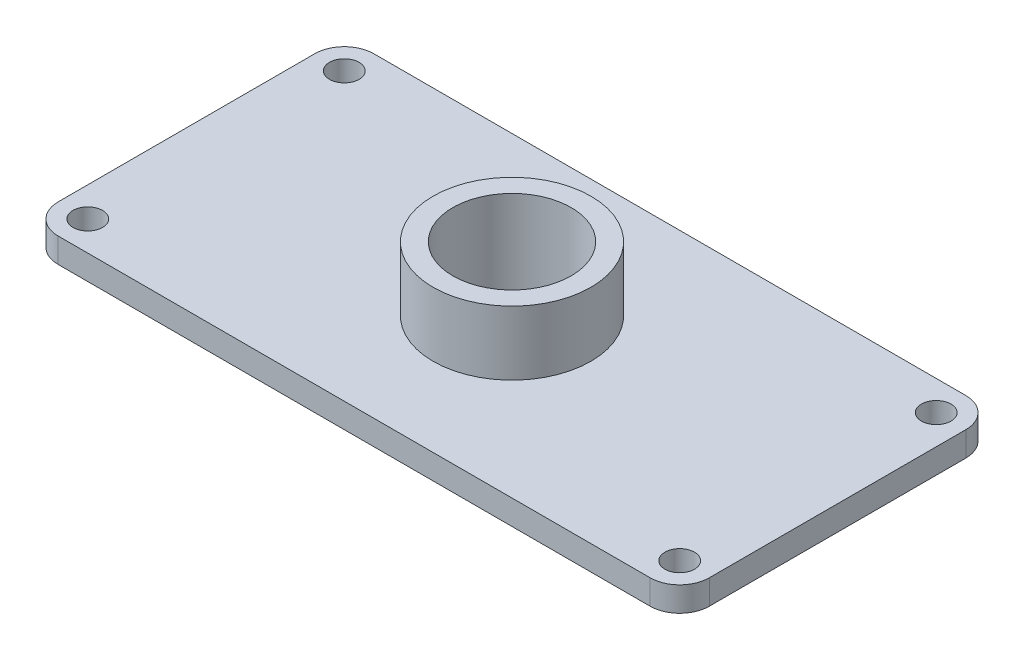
ISO-10303-21;
HEADER;
FILE_DESCRIPTION(('STEP AP214'),'2;1');
FILE_NAME('part.step','',(''),(''),'','','');
FILE_SCHEMA(('AUTOMOTIVE_DESIGN { 1 0 10303 214 1 1 1 1 }'));
ENDSEC;
DATA;
#1=APPLICATION_CONTEXT('core data for automotive mechanical design processes');
#2=APPLICATION_PROTOCOL_DEFINITION('international standard','automotive_design',2000,#1);
#3=PRODUCT_CONTEXT('',#1,'mechanical');
#4=PRODUCT('Part','Part','',(#3));
#5=PRODUCT_RELATED_PRODUCT_CATEGORY('part','',(#4));
#6=PRODUCT_DEFINITION_FORMATION('','',#4);
#7=PRODUCT_DEFINITION_CONTEXT('part definition',#1,'design');
#8=PRODUCT_DEFINITION('design','',#6,#7);
#9=PRODUCT_DEFINITION_SHAPE('','',#8);
#10=(LENGTH_UNIT() NAMED_UNIT(*) SI_UNIT(.MILLI.,.METRE.));
#11=(NAMED_UNIT(*) PLANE_ANGLE_UNIT() SI_UNIT($,.RADIAN.));
#12=(NAMED_UNIT(*) SI_UNIT($,.STERADIAN.) SOLID_ANGLE_UNIT());
#13=UNCERTAINTY_MEASURE_WITH_UNIT(LENGTH_MEASURE(1.E-05),#10,'distance_accuracy_value','');
#14=(GEOMETRIC_REPRESENTATION_CONTEXT(3) GLOBAL_UNCERTAINTY_ASSIGNED_CONTEXT((#13)) GLOBAL_UNIT_ASSIGNED_CONTEXT((#10,
#11,#12)) REPRESENTATION_CONTEXT('',''));
#15=CARTESIAN_POINT('',(0.,0.,0.));
#16=DIRECTION('',(0.,0.,1.));
#17=DIRECTION('',(1.,0.,0.));
#18=AXIS2_PLACEMENT_3D('',#15,#16,#17);
#19=CARTESIAN_POINT('',(60.,5.,-26.));
#20=DIRECTION('',(0.,-1.,0.));
#21=DIRECTION('',(0.,0.,-1.));
#22=AXIS2_PLACEMENT_3D('',#19,#20,#21);
#23=PLANE('',#22);
#24=CARTESIAN_POINT('',(-60.,5.,26.));
#25=DIRECTION('',(0.,1.,0.));
#26=DIRECTION('',(0.,0.,1.));
#27=AXIS2_PLACEMENT_3D('',#24,#25,#26);
#28=CIRCLE('',#27,3.);
#29=CARTESIAN_POINT('',(-60.,5.,29.));
#30=VERTEX_POINT('',#29);
#31=EDGE_CURVE('E212',#30,#30,#28,.T.);
#32=ORIENTED_EDGE('',*,*,#31,.F.);
#33=EDGE_LOOP('',(#32));
#34=FACE_BOUND('',#33,.T.);
#35=CARTESIAN_POINT('',(60.,5.,26.));
#36=DIRECTION('',(0.,1.,0.));
#37=DIRECTION('',(0.,0.,1.));
#38=AXIS2_PLACEMENT_3D('',#35,#36,#37);
#39=CIRCLE('',#38,3.);
#40=CARTESIAN_POINT('',(60.,5.,29.));
#41=VERTEX_POINT('',#40);
#42=EDGE_CURVE('E206',#41,#41,#39,.T.);
#43=ORIENTED_EDGE('',*,*,#42,.F.);
#44=EDGE_LOOP('',(#43));
#45=FACE_BOUND('',#44,.T.);
#46=CARTESIAN_POINT('',(60.,5.,-26.));
#47=DIRECTION('',(0.,1.,0.));
#48=DIRECTION('',(0.,0.,1.));
#49=AXIS2_PLACEMENT_3D('',#46,#47,#48);
#50=CIRCLE('',#49,3.);
#51=CARTESIAN_POINT('',(60.,5.,-23.));
#52=VERTEX_POINT('',#51);
#53=EDGE_CURVE('E200',#52,#52,#50,.T.);
#54=ORIENTED_EDGE('',*,*,#53,.F.);
#55=EDGE_LOOP('',(#54));
#56=FACE_BOUND('',#55,.T.);
#57=CARTESIAN_POINT('',(-60.,5.,-26.));
#58=DIRECTION('',(0.,1.,0.));
#59=DIRECTION('',(0.,0.,1.));
#60=AXIS2_PLACEMENT_3D('',#57,#58,#59);
#61=CIRCLE('',#60,3.);
#62=CARTESIAN_POINT('',(-60.,5.,-23.));
#63=VERTEX_POINT('',#62);
#64=EDGE_CURVE('E196',#63,#63,#61,.T.);
#65=ORIENTED_EDGE('',*,*,#64,.F.);
#66=EDGE_LOOP('',(#65));
#67=FACE_BOUND('',#66,.T.);
#68=CARTESIAN_POINT('',(60.,5.,-26.));
#69=DIRECTION('',(0.,1.,0.));
#70=DIRECTION('',(0.,0.,-1.));
#71=AXIS2_PLACEMENT_3D('',#68,#69,#70);
#72=CIRCLE('',#71,6.);
#73=CARTESIAN_POINT('',(66.,5.,-26.));
#74=VERTEX_POINT('',#73);
#75=CARTESIAN_POINT('',(60.,5.,-32.));
#76=VERTEX_POINT('',#75);
#77=EDGE_CURVE('E156',#74,#76,#72,.T.);
#78=ORIENTED_EDGE('',*,*,#77,.T.);
#79=DIRECTION('',(-1.,0.,0.));
#80=VECTOR('',#79,1.);
#81=CARTESIAN_POINT('',(-60.,5.,-32.));
#82=LINE('',#81,#80);
#83=CARTESIAN_POINT('',(-60.,5.,-32.));
#84=VERTEX_POINT('',#83);
#85=EDGE_CURVE('E104',#76,#84,#82,.T.);
#86=ORIENTED_EDGE('',*,*,#85,.T.);
#87=CARTESIAN_POINT('',(-60.,5.,-26.));
#88=DIRECTION('',(0.,1.,0.));
#89=DIRECTION('',(0.,0.,-1.));
#90=AXIS2_PLACEMENT_3D('',#87,#88,#89);
#91=CIRCLE('',#90,6.);
#92=CARTESIAN_POINT('',(-66.,5.,-26.));
#93=VERTEX_POINT('',#92);
#94=EDGE_CURVE('E188',#84,#93,#91,.T.);
#95=ORIENTED_EDGE('',*,*,#94,.T.);
#96=DIRECTION('',(0.,0.,1.));
#97=VECTOR('',#96,1.);
#98=CARTESIAN_POINT('',(-66.,5.,26.));
#99=LINE('',#98,#97);
#100=CARTESIAN_POINT('',(-66.,5.,26.));
#101=VERTEX_POINT('',#100);
#102=EDGE_CURVE('E187',#93,#101,#99,.T.);
#103=ORIENTED_EDGE('',*,*,#102,.T.);
#104=CARTESIAN_POINT('',(-60.,5.,26.));
#105=DIRECTION('',(0.,1.,0.));
#106=DIRECTION('',(0.,0.,-1.));
#107=AXIS2_PLACEMENT_3D('',#104,#105,#106);
#108=CIRCLE('',#107,6.);
#109=CARTESIAN_POINT('',(-60.,5.,32.));
#110=VERTEX_POINT('',#109);
#111=EDGE_CURVE('E123',#101,#110,#108,.T.);
#112=ORIENTED_EDGE('',*,*,#111,.T.);
#113=DIRECTION('',(1.,0.,0.));
#114=VECTOR('',#113,1.);
#115=CARTESIAN_POINT('',(-60.,5.,32.));
#116=LINE('',#115,#114);
#117=CARTESIAN_POINT('',(60.,5.,32.));
#118=VERTEX_POINT('',#117);
#119=EDGE_CURVE('E117',#110,#118,#116,.T.);
#120=ORIENTED_EDGE('',*,*,#119,.T.);
#121=CARTESIAN_POINT('',(60.,5.,26.));
#122=DIRECTION('',(0.,1.,0.));
#123=DIRECTION('',(0.,0.,-1.));
#124=AXIS2_PLACEMENT_3D('',#121,#122,#123);
#125=CIRCLE('',#124,6.);
#126=CARTESIAN_POINT('',(66.,5.,26.));
#127=VERTEX_POINT('',#126);
#128=EDGE_CURVE('E121',#118,#127,#125,.T.);
#129=ORIENTED_EDGE('',*,*,#128,.T.);
#130=DIRECTION('',(0.,0.,-1.));
#131=VECTOR('',#130,1.);
#132=CARTESIAN_POINT('',(66.,5.,26.));
#133=LINE('',#132,#131);
#134=EDGE_CURVE('E60',#127,#74,#133,.T.);
#135=ORIENTED_EDGE('',*,*,#134,.T.);
#136=EDGE_LOOP('',(#78,#86,#95,#103,#112,#120,#129,#135));
#137=FACE_BOUND('',#136,.T.);
#138=CARTESIAN_POINT('',(0.,5.,0.));
#139=DIRECTION('',(0.,-1.,0.));
#140=DIRECTION('',(0.,0.,-1.));
#141=AXIS2_PLACEMENT_3D('',#138,#139,#140);
#142=CIRCLE('',#141,16.);
#143=CARTESIAN_POINT('',(0.,5.,-16.));
#144=VERTEX_POINT('',#143);
#145=EDGE_CURVE('E11',#144,#144,#142,.F.);
#146=ORIENTED_EDGE('',*,*,#145,.F.);
#147=EDGE_LOOP('',(#146));
#148=FACE_BOUND('',#147,.T.);
#149=ADVANCED_FACE('F43',(#34,#45,#56,#67,#137,#148),#23,.F.);
#150=CARTESIAN_POINT('',(60.,0.,-26.));
#151=DIRECTION('',(0.,-1.,0.));
#152=DIRECTION('',(0.,0.,-1.));
#153=AXIS2_PLACEMENT_3D('',#150,#151,#152);
#154=PLANE('',#153);
#155=CARTESIAN_POINT('',(60.,0.,26.));
#156=DIRECTION('',(0.,1.,0.));
#157=DIRECTION('',(0.,0.,1.));
#158=AXIS2_PLACEMENT_3D('',#155,#156,#157);
#159=CIRCLE('',#158,3.);
#160=CARTESIAN_POINT('',(60.,0.,29.));
#161=VERTEX_POINT('',#160);
#162=EDGE_CURVE('E209',#161,#161,#159,.T.);
#163=ORIENTED_EDGE('',*,*,#162,.T.);
#164=EDGE_LOOP('',(#163));
#165=FACE_BOUND('',#164,.T.);
#166=CARTESIAN_POINT('',(-60.,0.,-26.));
#167=DIRECTION('',(0.,1.,0.));
#168=DIRECTION('',(0.,0.,1.));
#169=AXIS2_PLACEMENT_3D('',#166,#167,#168);
#170=CIRCLE('',#169,3.);
#171=CARTESIAN_POINT('',(-60.,0.,-23.));
#172=VERTEX_POINT('',#171);
#173=EDGE_CURVE('E197',#172,#172,#170,.T.);
#174=ORIENTED_EDGE('',*,*,#173,.T.);
#175=EDGE_LOOP('',(#174));
#176=FACE_BOUND('',#175,.T.);
#177=CARTESIAN_POINT('',(60.,0.,-26.));
#178=DIRECTION('',(0.,1.,0.));
#179=DIRECTION('',(0.,0.,-1.));
#180=AXIS2_PLACEMENT_3D('',#177,#178,#179);
#181=CIRCLE('',#180,6.);
#182=CARTESIAN_POINT('',(66.,0.,-26.));
#183=VERTEX_POINT('',#182);
#184=CARTESIAN_POINT('',(60.,0.,-32.));
#185=VERTEX_POINT('',#184);
#186=EDGE_CURVE('E141',#183,#185,#181,.T.);
#187=ORIENTED_EDGE('',*,*,#186,.F.);
#188=DIRECTION('',(0.,0.,-1.));
#189=VECTOR('',#188,1.);
#190=CARTESIAN_POINT('',(66.,0.,26.));
#191=LINE('',#190,#189);
#192=CARTESIAN_POINT('',(66.,0.,26.));
#193=VERTEX_POINT('',#192);
#194=EDGE_CURVE('E95',#193,#183,#191,.T.);
#195=ORIENTED_EDGE('',*,*,#194,.F.);
#196=CARTESIAN_POINT('',(60.,0.,26.));
#197=DIRECTION('',(0.,1.,0.));
#198=DIRECTION('',(0.,0.,-1.));
#199=AXIS2_PLACEMENT_3D('',#196,#197,#198);
#200=CIRCLE('',#199,6.);
#201=CARTESIAN_POINT('',(60.,0.,32.));
#202=VERTEX_POINT('',#201);
#203=EDGE_CURVE('E89',#202,#193,#200,.T.);
#204=ORIENTED_EDGE('',*,*,#203,.F.);
#205=DIRECTION('',(1.,0.,0.));
#206=VECTOR('',#205,1.);
#207=CARTESIAN_POINT('',(-60.,0.,32.));
#208=LINE('',#207,#206);
#209=CARTESIAN_POINT('',(-60.,0.,32.));
#210=VERTEX_POINT('',#209);
#211=EDGE_CURVE('E131',#210,#202,#208,.T.);
#212=ORIENTED_EDGE('',*,*,#211,.F.);
#213=CARTESIAN_POINT('',(-60.,0.,26.));
#214=DIRECTION('',(0.,1.,0.));
#215=DIRECTION('',(0.,0.,-1.));
#216=AXIS2_PLACEMENT_3D('',#213,#214,#215);
#217=CIRCLE('',#216,6.);
#218=CARTESIAN_POINT('',(-66.,0.,26.));
#219=VERTEX_POINT('',#218);
#220=EDGE_CURVE('E151',#219,#210,#217,.T.);
#221=ORIENTED_EDGE('',*,*,#220,.F.);
#222=DIRECTION('',(0.,0.,1.));
#223=VECTOR('',#222,1.);
#224=CARTESIAN_POINT('',(-66.,0.,26.));
#225=LINE('',#224,#223);
#226=CARTESIAN_POINT('',(-66.,0.,-26.));
#227=VERTEX_POINT('',#226);
#228=EDGE_CURVE('E149',#227,#219,#225,.T.);
#229=ORIENTED_EDGE('',*,*,#228,.F.);
#230=CARTESIAN_POINT('',(-60.,0.,-26.));
#231=DIRECTION('',(0.,1.,0.));
#232=DIRECTION('',(0.,0.,-1.));
#233=AXIS2_PLACEMENT_3D('',#230,#231,#232);
#234=CIRCLE('',#233,6.);
#235=CARTESIAN_POINT('',(-60.,0.,-32.));
#236=VERTEX_POINT('',#235);
#237=EDGE_CURVE('E147',#236,#227,#234,.T.);
#238=ORIENTED_EDGE('',*,*,#237,.F.);
#239=DIRECTION('',(-1.,0.,0.));
#240=VECTOR('',#239,1.);
#241=CARTESIAN_POINT('',(-60.,0.,-32.));
#242=LINE('',#241,#240);
#243=EDGE_CURVE('E144',#185,#236,#242,.T.);
#244=ORIENTED_EDGE('',*,*,#243,.F.);
#245=EDGE_LOOP('',(#187,#195,#204,#212,#221,#229,#238,#244));
#246=FACE_BOUND('',#245,.T.);
#247=CARTESIAN_POINT('',(0.,0.,0.));
#248=DIRECTION('',(0.,1.,0.));
#249=DIRECTION('',(0.,0.,1.));
#250=AXIS2_PLACEMENT_3D('',#247,#248,#249);
#251=CIRCLE('',#250,12.);
#252=CARTESIAN_POINT('',(0.,0.,12.));
#253=VERTEX_POINT('',#252);
#254=EDGE_CURVE('E145',#253,#253,#251,.T.);
#255=ORIENTED_EDGE('',*,*,#254,.T.);
#256=EDGE_LOOP('',(#255));
#257=FACE_BOUND('',#256,.T.);
#258=CARTESIAN_POINT('',(60.,0.,-26.));
#259=DIRECTION('',(0.,1.,0.));
#260=DIRECTION('',(0.,0.,1.));
#261=AXIS2_PLACEMENT_3D('',#258,#259,#260);
#262=CIRCLE('',#261,3.);
#263=CARTESIAN_POINT('',(60.,0.,-23.));
#264=VERTEX_POINT('',#263);
#265=EDGE_CURVE('E203',#264,#264,#262,.T.);
#266=ORIENTED_EDGE('',*,*,#265,.T.);
#267=EDGE_LOOP('',(#266));
#268=FACE_BOUND('',#267,.T.);
#269=CARTESIAN_POINT('',(-60.,0.,26.));
#270=DIRECTION('',(0.,1.,0.));
#271=DIRECTION('',(0.,0.,1.));
#272=AXIS2_PLACEMENT_3D('',#269,#270,#271);
#273=CIRCLE('',#272,3.);
#274=CARTESIAN_POINT('',(-60.,0.,29.));
#275=VERTEX_POINT('',#274);
#276=EDGE_CURVE('E215',#275,#275,#273,.T.);
#277=ORIENTED_EDGE('',*,*,#276,.T.);
#278=EDGE_LOOP('',(#277));
#279=FACE_BOUND('',#278,.T.);
#280=ADVANCED_FACE('F174',(#165,#176,#246,#257,#268,#279),#154,.T.);
#281=CARTESIAN_POINT('',(60.,5.,-26.));
#282=DIRECTION('',(0.,-1.,0.));
#283=DIRECTION('',(0.,0.,-1.));
#284=AXIS2_PLACEMENT_3D('',#281,#282,#283);
#285=CYLINDRICAL_SURFACE('',#284,6.);
#286=ORIENTED_EDGE('',*,*,#186,.T.);
#287=DIRECTION('',(0.,-1.,0.));
#288=VECTOR('',#287,1.);
#289=CARTESIAN_POINT('',(60.,5.,-32.));
#290=LINE('',#289,#288);
#291=EDGE_CURVE('E52',#76,#185,#290,.T.);
#292=ORIENTED_EDGE('',*,*,#291,.F.);
#293=ORIENTED_EDGE('',*,*,#77,.F.);
#294=DIRECTION('',(0.,-1.,0.));
#295=VECTOR('',#294,1.);
#296=CARTESIAN_POINT('',(66.,5.,-26.));
#297=LINE('',#296,#295);
#298=EDGE_CURVE('E137',#74,#183,#297,.T.);
#299=ORIENTED_EDGE('',*,*,#298,.T.);
#300=EDGE_LOOP('',(#286,#292,#293,#299));
#301=FACE_BOUND('',#300,.T.);
#302=ADVANCED_FACE('F45',(#301),#285,.T.);
#303=CARTESIAN_POINT('',(-60.,5.,-32.));
#304=DIRECTION('',(0.,0.,1.));
#305=DIRECTION('',(1.,0.,0.));
#306=AXIS2_PLACEMENT_3D('',#303,#304,#305);
#307=PLANE('',#306);
#308=ORIENTED_EDGE('',*,*,#243,.T.);
#309=DIRECTION('',(0.,-1.,0.));
#310=VECTOR('',#309,1.);
#311=CARTESIAN_POINT('',(-60.,5.,-32.));
#312=LINE('',#311,#310);
#313=EDGE_CURVE('E166',#84,#236,#312,.T.);
#314=ORIENTED_EDGE('',*,*,#313,.F.);
#315=ORIENTED_EDGE('',*,*,#85,.F.);
#316=ORIENTED_EDGE('',*,*,#291,.T.);
#317=EDGE_LOOP('',(#308,#314,#315,#316));
#318=FACE_BOUND('',#317,.T.);
#319=ADVANCED_FACE('F169',(#318),#307,.F.);
#320=CARTESIAN_POINT('',(-60.,5.,-26.));
#321=DIRECTION('',(0.,-1.,0.));
#322=DIRECTION('',(0.,0.,-1.));
#323=AXIS2_PLACEMENT_3D('',#320,#321,#322);
#324=CYLINDRICAL_SURFACE('',#323,6.);
#325=ORIENTED_EDGE('',*,*,#237,.T.);
#326=DIRECTION('',(0.,-1.,0.));
#327=VECTOR('',#326,1.);
#328=CARTESIAN_POINT('',(-66.,5.,-26.));
#329=LINE('',#328,#327);
#330=EDGE_CURVE('E163',#93,#227,#329,.T.);
#331=ORIENTED_EDGE('',*,*,#330,.F.);
#332=ORIENTED_EDGE('',*,*,#94,.F.);
#333=ORIENTED_EDGE('',*,*,#313,.T.);
#334=EDGE_LOOP('',(#325,#331,#332,#333));
#335=FACE_BOUND('',#334,.T.);
#336=ADVANCED_FACE('F181',(#335),#324,.T.);
#337=CARTESIAN_POINT('',(-66.,5.,26.));
#338=DIRECTION('',(1.,0.,0.));
#339=DIRECTION('',(0.,0.,-1.));
#340=AXIS2_PLACEMENT_3D('',#337,#338,#339);
#341=PLANE('',#340);
#342=ORIENTED_EDGE('',*,*,#228,.T.);
#343=DIRECTION('',(0.,-1.,0.));
#344=VECTOR('',#343,1.);
#345=CARTESIAN_POINT('',(-66.,5.,26.));
#346=LINE('',#345,#344);
#347=EDGE_CURVE('E160',#101,#219,#346,.T.);
#348=ORIENTED_EDGE('',*,*,#347,.F.);
#349=ORIENTED_EDGE('',*,*,#102,.F.);
#350=ORIENTED_EDGE('',*,*,#330,.T.);
#351=EDGE_LOOP('',(#342,#348,#349,#350));
#352=FACE_BOUND('',#351,.T.);
#353=ADVANCED_FACE('F185',(#352),#341,.F.);
#354=CARTESIAN_POINT('',(-60.,5.,26.));
#355=DIRECTION('',(0.,-1.,0.));
#356=DIRECTION('',(0.,0.,-1.));
#357=AXIS2_PLACEMENT_3D('',#354,#355,#356);
#358=CYLINDRICAL_SURFACE('',#357,6.);
#359=ORIENTED_EDGE('',*,*,#220,.T.);
#360=DIRECTION('',(0.,-1.,0.));
#361=VECTOR('',#360,1.);
#362=CARTESIAN_POINT('',(-60.,5.,32.));
#363=LINE('',#362,#361);
#364=EDGE_CURVE('E132',#110,#210,#363,.T.);
#365=ORIENTED_EDGE('',*,*,#364,.F.);
#366=ORIENTED_EDGE('',*,*,#111,.F.);
#367=ORIENTED_EDGE('',*,*,#347,.T.);
#368=EDGE_LOOP('',(#359,#365,#366,#367));
#369=FACE_BOUND('',#368,.T.);
#370=ADVANCED_FACE('F265',(#369),#358,.T.);
#371=CARTESIAN_POINT('',(-60.,5.,32.));
#372=DIRECTION('',(0.,0.,-1.));
#373=DIRECTION('',(-1.,0.,0.));
#374=AXIS2_PLACEMENT_3D('',#371,#372,#373);
#375=PLANE('',#374);
#376=ORIENTED_EDGE('',*,*,#211,.T.);
#377=DIRECTION('',(0.,-1.,0.));
#378=VECTOR('',#377,1.);
#379=CARTESIAN_POINT('',(60.,5.,32.));
#380=LINE('',#379,#378);
#381=EDGE_CURVE('E128',#118,#202,#380,.T.);
#382=ORIENTED_EDGE('',*,*,#381,.F.);
#383=ORIENTED_EDGE('',*,*,#119,.F.);
#384=ORIENTED_EDGE('',*,*,#364,.T.);
#385=EDGE_LOOP('',(#376,#382,#383,#384));
#386=FACE_BOUND('',#385,.T.);
#387=ADVANCED_FACE('F129',(#386),#375,.F.);
#388=CARTESIAN_POINT('',(60.,5.,26.));
#389=DIRECTION('',(0.,-1.,0.));
#390=DIRECTION('',(0.,0.,-1.));
#391=AXIS2_PLACEMENT_3D('',#388,#389,#390);
#392=CYLINDRICAL_SURFACE('',#391,6.);
#393=ORIENTED_EDGE('',*,*,#203,.T.);
#394=DIRECTION('',(0.,-1.,0.));
#395=VECTOR('',#394,1.);
#396=CARTESIAN_POINT('',(66.,5.,26.));
#397=LINE('',#396,#395);
#398=EDGE_CURVE('E133',#127,#193,#397,.T.);
#399=ORIENTED_EDGE('',*,*,#398,.F.);
#400=ORIENTED_EDGE('',*,*,#128,.F.);
#401=ORIENTED_EDGE('',*,*,#381,.T.);
#402=EDGE_LOOP('',(#393,#399,#400,#401));
#403=FACE_BOUND('',#402,.T.);
#404=ADVANCED_FACE('F135',(#403),#392,.T.);
#405=CARTESIAN_POINT('',(66.,5.,26.));
#406=DIRECTION('',(-1.,0.,0.));
#407=DIRECTION('',(0.,0.,1.));
#408=AXIS2_PLACEMENT_3D('',#405,#406,#407);
#409=PLANE('',#408);
#410=ORIENTED_EDGE('',*,*,#194,.T.);
#411=ORIENTED_EDGE('',*,*,#298,.F.);
#412=ORIENTED_EDGE('',*,*,#134,.F.);
#413=ORIENTED_EDGE('',*,*,#398,.T.);
#414=EDGE_LOOP('',(#410,#411,#412,#413));
#415=FACE_BOUND('',#414,.T.);
#416=ADVANCED_FACE('F258',(#415),#409,.F.);
#417=CARTESIAN_POINT('',(0.,5.,0.));
#418=DIRECTION('',(0.,-1.,0.));
#419=DIRECTION('',(0.,0.,-1.));
#420=AXIS2_PLACEMENT_3D('',#417,#418,#419);
#421=CYLINDRICAL_SURFACE('',#420,12.);
#422=ORIENTED_EDGE('',*,*,#254,.F.);
#423=EDGE_LOOP('',(#422));
#424=FACE_BOUND('',#423,.T.);
#425=CARTESIAN_POINT('',(0.,18.,0.));
#426=DIRECTION('',(0.,1.,0.));
#427=DIRECTION('',(0.,0.,1.));
#428=AXIS2_PLACEMENT_3D('',#425,#426,#427);
#429=CIRCLE('',#428,12.);
#430=CARTESIAN_POINT('',(0.,18.,12.));
#431=VERTEX_POINT('',#430);
#432=EDGE_CURVE('E223',#431,#431,#429,.T.);
#433=ORIENTED_EDGE('',*,*,#432,.T.);
#434=EDGE_LOOP('',(#433));
#435=FACE_BOUND('',#434,.T.);
#436=ADVANCED_FACE('F227',(#424,#435),#421,.F.);
#437=CARTESIAN_POINT('',(-60.,5.,-26.));
#438=DIRECTION('',(0.,-1.,0.));
#439=DIRECTION('',(0.,0.,-1.));
#440=AXIS2_PLACEMENT_3D('',#437,#438,#439);
#441=CYLINDRICAL_SURFACE('',#440,3.);
#442=ORIENTED_EDGE('',*,*,#64,.T.);
#443=EDGE_LOOP('',(#442));
#444=FACE_BOUND('',#443,.T.);
#445=ORIENTED_EDGE('',*,*,#173,.F.);
#446=EDGE_LOOP('',(#445));
#447=FACE_BOUND('',#446,.T.);
#448=ADVANCED_FACE('F326',(#444,#447),#441,.F.);
#449=CARTESIAN_POINT('',(60.,5.,-26.));
#450=DIRECTION('',(0.,-1.,0.));
#451=DIRECTION('',(0.,0.,-1.));
#452=AXIS2_PLACEMENT_3D('',#449,#450,#451);
#453=CYLINDRICAL_SURFACE('',#452,3.);
#454=ORIENTED_EDGE('',*,*,#53,.T.);
#455=EDGE_LOOP('',(#454));
#456=FACE_BOUND('',#455,.T.);
#457=ORIENTED_EDGE('',*,*,#265,.F.);
#458=EDGE_LOOP('',(#457));
#459=FACE_BOUND('',#458,.T.);
#460=ADVANCED_FACE('F335',(#456,#459),#453,.F.);
#461=CARTESIAN_POINT('',(60.,5.,26.));
#462=DIRECTION('',(0.,-1.,0.));
#463=DIRECTION('',(0.,0.,-1.));
#464=AXIS2_PLACEMENT_3D('',#461,#462,#463);
#465=CYLINDRICAL_SURFACE('',#464,3.);
#466=ORIENTED_EDGE('',*,*,#42,.T.);
#467=EDGE_LOOP('',(#466));
#468=FACE_BOUND('',#467,.T.);
#469=ORIENTED_EDGE('',*,*,#162,.F.);
#470=EDGE_LOOP('',(#469));
#471=FACE_BOUND('',#470,.T.);
#472=ADVANCED_FACE('F242',(#468,#471),#465,.F.);
#473=CARTESIAN_POINT('',(-60.,5.,26.));
#474=DIRECTION('',(0.,-1.,0.));
#475=DIRECTION('',(0.,0.,-1.));
#476=AXIS2_PLACEMENT_3D('',#473,#474,#475);
#477=CYLINDRICAL_SURFACE('',#476,3.);
#478=ORIENTED_EDGE('',*,*,#31,.T.);
#479=EDGE_LOOP('',(#478));
#480=FACE_BOUND('',#479,.T.);
#481=ORIENTED_EDGE('',*,*,#276,.F.);
#482=EDGE_LOOP('',(#481));
#483=FACE_BOUND('',#482,.T.);
#484=ADVANCED_FACE('F232',(#480,#483),#477,.F.);
#485=CARTESIAN_POINT('',(0.,18.,0.));
#486=DIRECTION('',(0.,1.,0.));
#487=DIRECTION('',(0.,0.,1.));
#488=AXIS2_PLACEMENT_3D('',#485,#486,#487);
#489=PLANE('',#488);
#490=CARTESIAN_POINT('',(0.,18.,0.));
#491=DIRECTION('',(0.,1.,0.));
#492=DIRECTION('',(0.,0.,1.));
#493=AXIS2_PLACEMENT_3D('',#490,#491,#492);
#494=CIRCLE('',#493,16.);
#495=CARTESIAN_POINT('',(0.,18.,-16.));
#496=VERTEX_POINT('',#495);
#497=EDGE_CURVE('E218',#496,#496,#494,.T.);
#498=ORIENTED_EDGE('',*,*,#497,.T.);
#499=EDGE_LOOP('',(#498));
#500=FACE_BOUND('',#499,.T.);
#501=ORIENTED_EDGE('',*,*,#432,.F.);
#502=EDGE_LOOP('',(#501));
#503=FACE_BOUND('',#502,.T.);
#504=ADVANCED_FACE('F229',(#500,#503),#489,.T.);
#505=CARTESIAN_POINT('',(0.,18.,0.));
#506=DIRECTION('',(0.,-1.,0.));
#507=DIRECTION('',(0.,0.,-1.));
#508=AXIS2_PLACEMENT_3D('',#505,#506,#507);
#509=CYLINDRICAL_SURFACE('',#508,16.);
#510=CARTESIAN_POINT('',(0.,18.,-16.));
#511=CARTESIAN_POINT('',(0.,17.8645833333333,-16.));
#512=CARTESIAN_POINT('',(0.,17.7291666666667,-16.));
#513=CARTESIAN_POINT('',(0.,17.4583333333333,-16.));
#514=CARTESIAN_POINT('',(0.,17.3229166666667,-16.));
#515=CARTESIAN_POINT('',(0.,17.0520833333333,-16.));
#516=CARTESIAN_POINT('',(0.,16.9166666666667,-16.));
#517=CARTESIAN_POINT('',(0.,16.6458333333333,-16.));
#518=CARTESIAN_POINT('',(0.,16.5104166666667,-16.));
#519=CARTESIAN_POINT('',(0.,16.2395833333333,-16.));
#520=CARTESIAN_POINT('',(0.,16.1041666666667,-16.));
#521=CARTESIAN_POINT('',(0.,15.8333333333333,-16.));
#522=CARTESIAN_POINT('',(0.,15.6979166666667,-16.));
#523=CARTESIAN_POINT('',(0.,15.4270833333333,-16.));
#524=CARTESIAN_POINT('',(0.,15.2916666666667,-16.));
#525=CARTESIAN_POINT('',(0.,15.0208333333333,-16.));
#526=CARTESIAN_POINT('',(0.,14.8854166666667,-16.));
#527=CARTESIAN_POINT('',(0.,14.6145833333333,-16.));
#528=CARTESIAN_POINT('',(0.,14.4791666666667,-16.));
#529=CARTESIAN_POINT('',(0.,14.2083333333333,-16.));
#530=CARTESIAN_POINT('',(0.,14.0729166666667,-16.));
#531=CARTESIAN_POINT('',(0.,13.8020833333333,-16.));
#532=CARTESIAN_POINT('',(0.,13.6666666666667,-16.));
#533=CARTESIAN_POINT('',(0.,13.3958333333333,-16.));
#534=CARTESIAN_POINT('',(0.,13.2604166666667,-16.));
#535=CARTESIAN_POINT('',(0.,12.9895833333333,-16.));
#536=CARTESIAN_POINT('',(0.,12.8541666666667,-16.));
#537=CARTESIAN_POINT('',(0.,12.5833333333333,-16.));
#538=CARTESIAN_POINT('',(0.,12.4479166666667,-16.));
#539=CARTESIAN_POINT('',(0.,12.1770833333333,-16.));
#540=CARTESIAN_POINT('',(0.,12.0416666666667,-16.));
#541=CARTESIAN_POINT('',(0.,11.7708333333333,-16.));
#542=CARTESIAN_POINT('',(0.,11.6354166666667,-16.));
#543=CARTESIAN_POINT('',(0.,11.3645833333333,-16.));
#544=CARTESIAN_POINT('',(0.,11.2291666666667,-16.));
#545=CARTESIAN_POINT('',(0.,10.9583333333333,-16.));
#546=CARTESIAN_POINT('',(0.,10.8229166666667,-16.));
#547=CARTESIAN_POINT('',(0.,10.5520833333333,-16.));
#548=CARTESIAN_POINT('',(0.,10.4166666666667,-16.));
#549=CARTESIAN_POINT('',(0.,10.1458333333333,-16.));
#550=CARTESIAN_POINT('',(0.,10.0104166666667,-16.));
#551=CARTESIAN_POINT('',(0.,9.73958333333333,-16.));
#552=CARTESIAN_POINT('',(0.,9.60416666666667,-16.));
#553=CARTESIAN_POINT('',(0.,9.33333333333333,-16.));
#554=CARTESIAN_POINT('',(0.,9.19791666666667,-16.));
#555=CARTESIAN_POINT('',(0.,8.92708333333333,-16.));
#556=CARTESIAN_POINT('',(0.,8.79166666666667,-16.));
#557=CARTESIAN_POINT('',(0.,8.52083333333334,-16.));
#558=CARTESIAN_POINT('',(0.,8.38541666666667,-16.));
#559=CARTESIAN_POINT('',(0.,8.11458333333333,-16.));
#560=CARTESIAN_POINT('',(0.,7.97916666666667,-16.));
#561=CARTESIAN_POINT('',(0.,7.70833333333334,-16.));
#562=CARTESIAN_POINT('',(0.,7.57291666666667,-16.));
#563=CARTESIAN_POINT('',(0.,7.30208333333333,-16.));
#564=CARTESIAN_POINT('',(0.,7.16666666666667,-16.));
#565=CARTESIAN_POINT('',(0.,6.89583333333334,-16.));
#566=CARTESIAN_POINT('',(0.,6.76041666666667,-16.));
#567=CARTESIAN_POINT('',(0.,6.48958333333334,-16.));
#568=CARTESIAN_POINT('',(0.,6.35416666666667,-16.));
#569=CARTESIAN_POINT('',(0.,6.08333333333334,-16.));
#570=CARTESIAN_POINT('',(0.,5.94791666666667,-16.));
#571=CARTESIAN_POINT('',(0.,5.67708333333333,-16.));
#572=CARTESIAN_POINT('',(0.,5.54166666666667,-16.));
#573=CARTESIAN_POINT('',(0.,5.27083333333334,-16.));
#574=CARTESIAN_POINT('',(0.,5.13541666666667,-16.));
#575=CARTESIAN_POINT('',(0.,5.,-16.));
#576=B_SPLINE_CURVE_WITH_KNOTS('',3,(#510,#511,#512,#513,#514,#515,#516,#517,#518,#519,#520,
#521,#522,#523,#524,#525,#526,#527,#528,#529,#530,#531,#532,#533,#534,#535,#536,#537,#538,#539,
#540,#541,#542,#543,#544,#545,#546,#547,#548,#549,#550,#551,#552,#553,#554,#555,#556,#557,#558,
#559,#560,#561,#562,#563,#564,#565,#566,#567,#568,#569,#570,#571,#572,#573,#574,#575),
.UNSPECIFIED.,.F.,.F.,(4,2,2,2,2,2,2,2,2,2,2,2,2,2,2,2,2,2,2,2,2,2,2,2,2,2,2,2,2,2,2,2,4),(0.,
0.40625,0.812500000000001,1.21875,1.625,2.03125,2.4375,2.84375,3.25,3.65625,4.0625,4.46875,
4.875,5.28125,5.6875,6.09375,6.5,6.90625,7.3125,7.71875,8.125,8.53125,8.9375,9.34375,9.75,
10.15625,10.5625,10.96875,11.375,11.78125,12.1875,12.59375,13.),.UNSPECIFIED.);
#577=EDGE_CURVE('BSEAM231',#496,#144,#576,.T.);
#578=ORIENTED_EDGE('',*,*,#497,.F.);
#579=ORIENTED_EDGE('',*,*,#145,.T.);
#580=ORIENTED_EDGE('',*,*,#577,.T.);
#581=ORIENTED_EDGE('',*,*,#577,.F.);
#582=EDGE_LOOP('',(#578,#580,#579,#581));
#583=FACE_BOUND('',#582,.T.);
#584=ADVANCED_FACE('F231',(#583),#509,.T.);
#585=CLOSED_SHELL('',(#149,#280,#302,#319,#336,#353,#370,#387,#404,#416,#436,#448,#460,#472,
#484,#504,#584));
#586=MANIFOLD_SOLID_BREP('B2',#585);
#587=ADVANCED_BREP_SHAPE_REPRESENTATION('',(#18,#586),#14);
#588=SHAPE_DEFINITION_REPRESENTATION(#9,#587);
ENDSEC;
END-ISO-10303-21;
